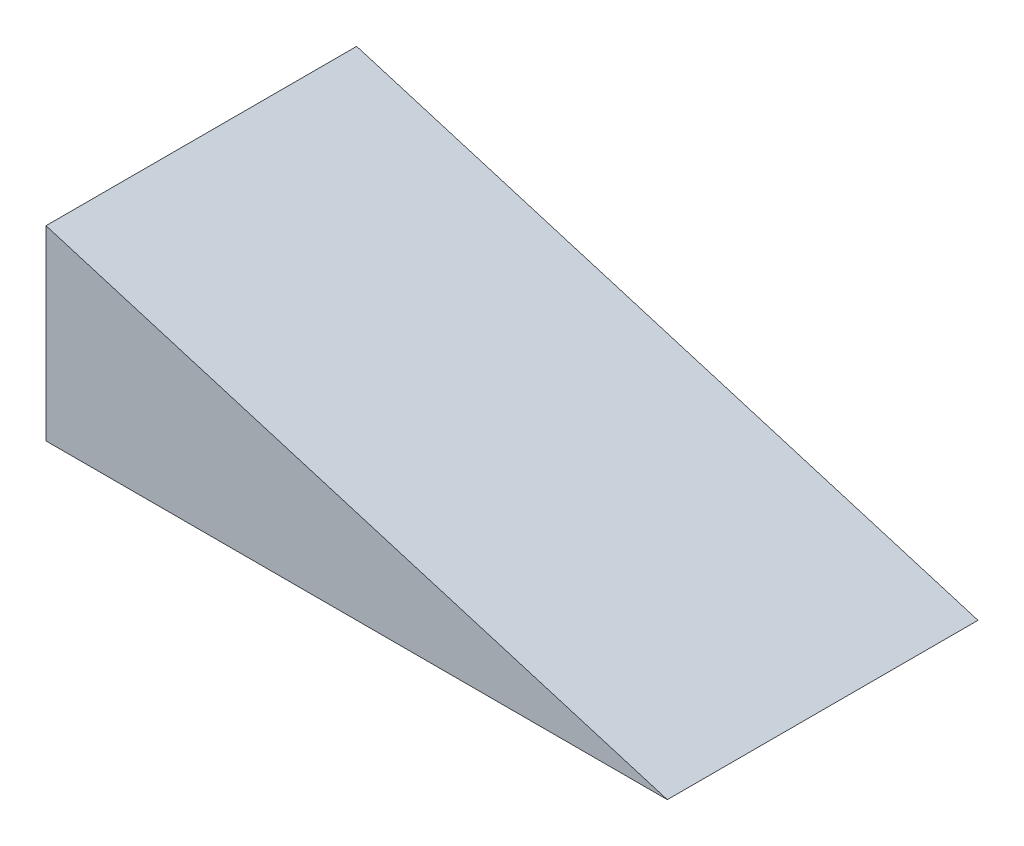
ISO-10303-21;
HEADER;
FILE_DESCRIPTION(('STEP AP214'),'2;1');
FILE_NAME('part.step','',(''),(''),'','','');
FILE_SCHEMA(('AUTOMOTIVE_DESIGN { 1 0 10303 214 1 1 1 1 }'));
ENDSEC;
DATA;
#1=APPLICATION_CONTEXT('core data for automotive mechanical design processes');
#2=APPLICATION_PROTOCOL_DEFINITION('international standard','automotive_design',2000,#1);
#3=PRODUCT_CONTEXT('',#1,'mechanical');
#4=PRODUCT('Part','Part','',(#3));
#5=PRODUCT_RELATED_PRODUCT_CATEGORY('part','',(#4));
#6=PRODUCT_DEFINITION_FORMATION('','',#4);
#7=PRODUCT_DEFINITION_CONTEXT('part definition',#1,'design');
#8=PRODUCT_DEFINITION('design','',#6,#7);
#9=PRODUCT_DEFINITION_SHAPE('','',#8);
#10=(LENGTH_UNIT() NAMED_UNIT(*) SI_UNIT(.MILLI.,.METRE.));
#11=(NAMED_UNIT(*) PLANE_ANGLE_UNIT() SI_UNIT($,.RADIAN.));
#12=(NAMED_UNIT(*) SI_UNIT($,.STERADIAN.) SOLID_ANGLE_UNIT());
#13=UNCERTAINTY_MEASURE_WITH_UNIT(LENGTH_MEASURE(1.E-05),#10,'distance_accuracy_value','');
#14=(GEOMETRIC_REPRESENTATION_CONTEXT(3) GLOBAL_UNCERTAINTY_ASSIGNED_CONTEXT((#13)) GLOBAL_UNIT_ASSIGNED_CONTEXT((#10,
#11,#12)) REPRESENTATION_CONTEXT('',''));
#15=CARTESIAN_POINT('',(0.,0.,0.));
#16=DIRECTION('',(0.,0.,1.));
#17=DIRECTION('',(1.,0.,0.));
#18=AXIS2_PLACEMENT_3D('',#15,#16,#17);
#19=CARTESIAN_POINT('',(20.,0.,10.));
#20=DIRECTION('',(-0.287347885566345,-0.957826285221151,0.));
#21=DIRECTION('',(0.957826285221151,-0.287347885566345,0.));
#22=AXIS2_PLACEMENT_3D('',#19,#20,#21);
#23=PLANE('',#22);
#24=DIRECTION('',(-0.957826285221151,0.287347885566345,0.));
#25=VECTOR('',#24,1.);
#26=CARTESIAN_POINT('',(20.,0.,0.));
#27=LINE('',#26,#25);
#28=CARTESIAN_POINT('',(20.,0.,0.));
#29=VERTEX_POINT('',#28);
#30=CARTESIAN_POINT('',(0.,6.,0.));
#31=VERTEX_POINT('',#30);
#32=EDGE_CURVE('E68',#29,#31,#27,.T.);
#33=ORIENTED_EDGE('',*,*,#32,.T.);
#34=DIRECTION('',(0.,0.,-1.));
#35=VECTOR('',#34,1.);
#36=CARTESIAN_POINT('',(0.,6.,10.));
#37=LINE('',#36,#35);
#38=CARTESIAN_POINT('',(0.,6.,10.));
#39=VERTEX_POINT('',#38);
#40=EDGE_CURVE('E11',#39,#31,#37,.T.);
#41=ORIENTED_EDGE('',*,*,#40,.F.);
#42=DIRECTION('',(-0.957826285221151,0.287347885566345,0.));
#43=VECTOR('',#42,1.);
#44=CARTESIAN_POINT('',(20.,0.,10.));
#45=LINE('',#44,#43);
#46=CARTESIAN_POINT('',(20.,0.,10.));
#47=VERTEX_POINT('',#46);
#48=EDGE_CURVE('E87',#47,#39,#45,.T.);
#49=ORIENTED_EDGE('',*,*,#48,.F.);
#50=DIRECTION('',(0.,0.,-1.));
#51=VECTOR('',#50,1.);
#52=CARTESIAN_POINT('',(20.,0.,10.));
#53=LINE('',#52,#51);
#54=EDGE_CURVE('E78',#47,#29,#53,.T.);
#55=ORIENTED_EDGE('',*,*,#54,.T.);
#56=EDGE_LOOP('',(#33,#41,#49,#55));
#57=FACE_BOUND('',#56,.T.);
#58=ADVANCED_FACE('F32',(#57),#23,.F.);
#59=CARTESIAN_POINT('',(0.,6.,10.));
#60=DIRECTION('',(1.,0.,0.));
#61=DIRECTION('',(0.,1.,0.));
#62=AXIS2_PLACEMENT_3D('',#59,#60,#61);
#63=PLANE('',#62);
#64=CARTESIAN_POINT('',(0.,3.,5.));
#65=DIRECTION('',(-1.,0.,0.));
#66=DIRECTION('',(0.,-1.,0.));
#67=AXIS2_PLACEMENT_3D('',#64,#65,#66);
#68=CIRCLE('',#67,1.5);
#69=CARTESIAN_POINT('',(0.,1.5,5.));
#70=VERTEX_POINT('',#69);
#71=EDGE_CURVE('E82',#70,#70,#68,.T.);
#72=ORIENTED_EDGE('',*,*,#71,.F.);
#73=EDGE_LOOP('',(#72));
#74=FACE_BOUND('',#73,.T.);
#75=DIRECTION('',(0.,-1.,0.));
#76=VECTOR('',#75,1.);
#77=CARTESIAN_POINT('',(0.,6.,0.));
#78=LINE('',#77,#76);
#79=CARTESIAN_POINT('',(0.,0.,0.));
#80=VERTEX_POINT('',#79);
#81=EDGE_CURVE('E65',#31,#80,#78,.T.);
#82=ORIENTED_EDGE('',*,*,#81,.T.);
#83=DIRECTION('',(0.,0.,-1.));
#84=VECTOR('',#83,1.);
#85=CARTESIAN_POINT('',(0.,0.,10.));
#86=LINE('',#85,#84);
#87=CARTESIAN_POINT('',(0.,0.,10.));
#88=VERTEX_POINT('',#87);
#89=EDGE_CURVE('E39',#88,#80,#86,.T.);
#90=ORIENTED_EDGE('',*,*,#89,.F.);
#91=DIRECTION('',(0.,-1.,0.));
#92=VECTOR('',#91,1.);
#93=CARTESIAN_POINT('',(0.,6.,10.));
#94=LINE('',#93,#92);
#95=EDGE_CURVE('E50',#39,#88,#94,.T.);
#96=ORIENTED_EDGE('',*,*,#95,.F.);
#97=ORIENTED_EDGE('',*,*,#40,.T.);
#98=EDGE_LOOP('',(#82,#90,#96,#97));
#99=FACE_BOUND('',#98,.T.);
#100=ADVANCED_FACE('F74',(#74,#99),#63,.F.);
#101=CARTESIAN_POINT('',(0.,0.,10.));
#102=DIRECTION('',(0.,1.,0.));
#103=DIRECTION('',(0.,0.,1.));
#104=AXIS2_PLACEMENT_3D('',#101,#102,#103);
#105=PLANE('',#104);
#106=DIRECTION('',(1.,0.,0.));
#107=VECTOR('',#106,1.);
#108=CARTESIAN_POINT('',(0.,0.,0.));
#109=LINE('',#108,#107);
#110=EDGE_CURVE('E69',#80,#29,#109,.T.);
#111=ORIENTED_EDGE('',*,*,#110,.T.);
#112=ORIENTED_EDGE('',*,*,#54,.F.);
#113=DIRECTION('',(1.,0.,0.));
#114=VECTOR('',#113,1.);
#115=CARTESIAN_POINT('',(0.,0.,10.));
#116=LINE('',#115,#114);
#117=EDGE_CURVE('E46',#88,#47,#116,.T.);
#118=ORIENTED_EDGE('',*,*,#117,.F.);
#119=ORIENTED_EDGE('',*,*,#89,.T.);
#120=EDGE_LOOP('',(#111,#112,#118,#119));
#121=FACE_BOUND('',#120,.T.);
#122=ADVANCED_FACE('F92',(#121),#105,.F.);
#123=CARTESIAN_POINT('',(0.,6.,10.));
#124=DIRECTION('',(0.,0.,1.));
#125=DIRECTION('',(1.,0.,0.));
#126=AXIS2_PLACEMENT_3D('',#123,#124,#125);
#127=PLANE('',#126);
#128=ORIENTED_EDGE('',*,*,#48,.T.);
#129=ORIENTED_EDGE('',*,*,#95,.T.);
#130=ORIENTED_EDGE('',*,*,#117,.T.);
#131=EDGE_LOOP('',(#128,#129,#130));
#132=FACE_BOUND('',#131,.T.);
#133=ADVANCED_FACE('F93',(#132),#127,.T.);
#134=CARTESIAN_POINT('',(0.,6.,0.));
#135=DIRECTION('',(0.,0.,1.));
#136=DIRECTION('',(1.,0.,0.));
#137=AXIS2_PLACEMENT_3D('',#134,#135,#136);
#138=PLANE('',#137);
#139=ORIENTED_EDGE('',*,*,#32,.F.);
#140=ORIENTED_EDGE('',*,*,#110,.F.);
#141=ORIENTED_EDGE('',*,*,#81,.F.);
#142=EDGE_LOOP('',(#139,#140,#141));
#143=FACE_BOUND('',#142,.T.);
#144=ADVANCED_FACE('F66',(#143),#138,.F.);
#145=CARTESIAN_POINT('',(4.,3.,5.));
#146=DIRECTION('',(-1.,0.,0.));
#147=DIRECTION('',(0.,-1.,0.));
#148=AXIS2_PLACEMENT_3D('',#145,#146,#147);
#149=CYLINDRICAL_SURFACE('',#148,1.5);
#150=CARTESIAN_POINT('',(4.,3.,5.));
#151=DIRECTION('',(-1.,0.,0.));
#152=DIRECTION('',(0.,-1.,0.));
#153=AXIS2_PLACEMENT_3D('',#150,#151,#152);
#154=CIRCLE('',#153,1.5);
#155=CARTESIAN_POINT('',(4.,1.5,5.));
#156=VERTEX_POINT('',#155);
#157=EDGE_CURVE('E79',#156,#156,#154,.T.);
#158=ORIENTED_EDGE('',*,*,#157,.F.);
#159=EDGE_LOOP('',(#158));
#160=FACE_BOUND('',#159,.T.);
#161=ORIENTED_EDGE('',*,*,#71,.T.);
#162=EDGE_LOOP('',(#161));
#163=FACE_BOUND('',#162,.T.);
#164=ADVANCED_FACE('F100',(#160,#163),#149,.F.);
#165=CARTESIAN_POINT('',(4.,3.,5.));
#166=DIRECTION('',(-1.,0.,0.));
#167=DIRECTION('',(0.,-1.,0.));
#168=AXIS2_PLACEMENT_3D('',#165,#166,#167);
#169=PLANE('',#168);
#170=ORIENTED_EDGE('',*,*,#157,.T.);
#171=EDGE_LOOP('',(#170));
#172=FACE_BOUND('',#171,.T.);
#173=ADVANCED_FACE('F114',(#172),#169,.T.);
#174=CLOSED_SHELL('',(#58,#100,#122,#133,#144,#164,#173));
#175=MANIFOLD_SOLID_BREP('B2',#174);
#176=ADVANCED_BREP_SHAPE_REPRESENTATION('',(#18,#175),#14);
#177=SHAPE_DEFINITION_REPRESENTATION(#9,#176);
ENDSEC;
END-ISO-10303-21;
